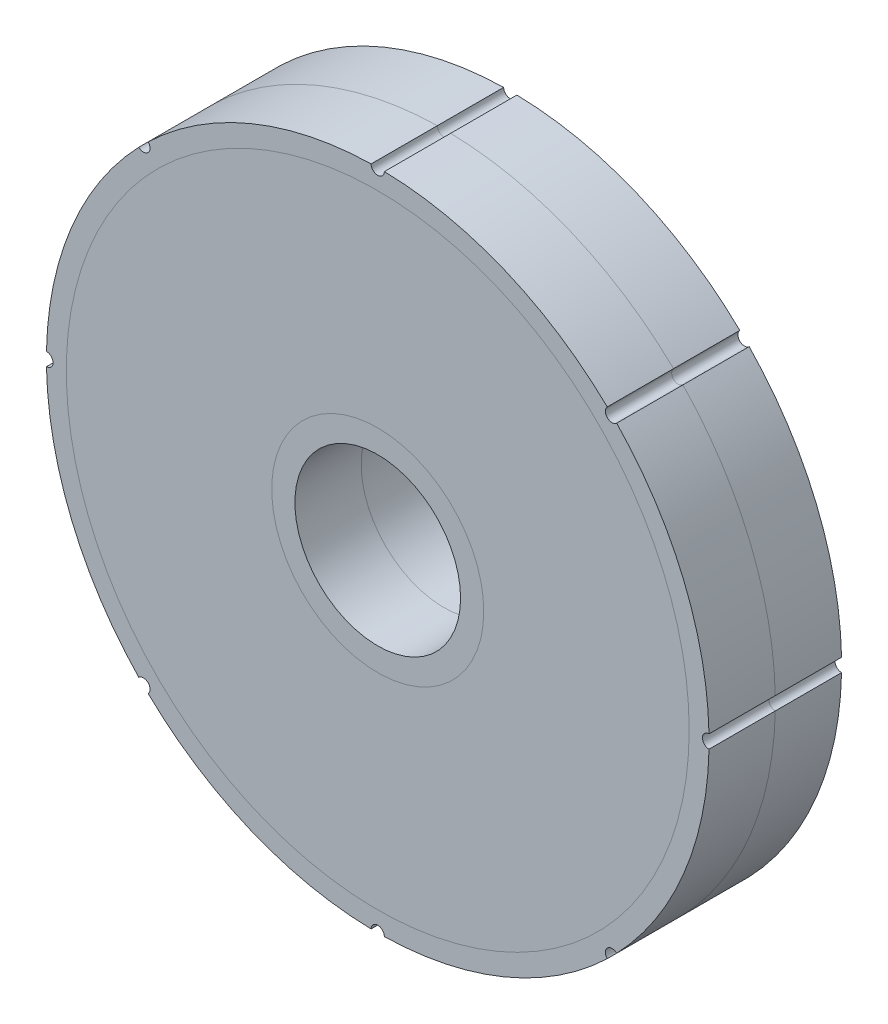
ISO-10303-21;
HEADER;
FILE_DESCRIPTION(('STEP AP214'),'2;1');
FILE_NAME('part.step','',(''),(''),'','','');
FILE_SCHEMA(('AUTOMOTIVE_DESIGN { 1 0 10303 214 1 1 1 1 }'));
ENDSEC;
DATA;
#1=APPLICATION_CONTEXT('core data for automotive mechanical design processes');
#2=APPLICATION_PROTOCOL_DEFINITION('international standard','automotive_design',2000,#1);
#3=PRODUCT_CONTEXT('',#1,'mechanical');
#4=PRODUCT('Part','Part','',(#3));
#5=PRODUCT_RELATED_PRODUCT_CATEGORY('part','',(#4));
#6=PRODUCT_DEFINITION_FORMATION('','',#4);
#7=PRODUCT_DEFINITION_CONTEXT('part definition',#1,'design');
#8=PRODUCT_DEFINITION('design','',#6,#7);
#9=PRODUCT_DEFINITION_SHAPE('','',#8);
#10=(LENGTH_UNIT() NAMED_UNIT(*) SI_UNIT(.MILLI.,.METRE.));
#11=(NAMED_UNIT(*) PLANE_ANGLE_UNIT() SI_UNIT($,.RADIAN.));
#12=(NAMED_UNIT(*) SI_UNIT($,.STERADIAN.) SOLID_ANGLE_UNIT());
#13=UNCERTAINTY_MEASURE_WITH_UNIT(LENGTH_MEASURE(1.E-05),#10,'distance_accuracy_value','');
#14=(GEOMETRIC_REPRESENTATION_CONTEXT(3) GLOBAL_UNCERTAINTY_ASSIGNED_CONTEXT((#13)) GLOBAL_UNIT_ASSIGNED_CONTEXT((#10,
#11,#12)) REPRESENTATION_CONTEXT('',''));
#15=CARTESIAN_POINT('',(0.,0.,0.));
#16=DIRECTION('',(0.,0.,1.));
#17=DIRECTION('',(1.,0.,0.));
#18=AXIS2_PLACEMENT_3D('',#15,#16,#17);
#19=CARTESIAN_POINT('',(0.,0.,0.));
#20=DIRECTION('',(0.,0.,1.));
#21=DIRECTION('',(1.,0.,0.));
#22=AXIS2_PLACEMENT_3D('',#19,#20,#21);
#23=PLANE('',#22);
#24=CARTESIAN_POINT('',(0.,0.,0.));
#25=DIRECTION('',(0.,0.,1.));
#26=DIRECTION('',(1.,0.,0.));
#27=AXIS2_PLACEMENT_3D('',#24,#25,#26);
#28=CIRCLE('',#27,12.5);
#29=CARTESIAN_POINT('',(12.5,0.,0.));
#30=VERTEX_POINT('',#29);
#31=EDGE_CURVE('E66',#30,#30,#28,.T.);
#32=ORIENTED_EDGE('',*,*,#31,.F.);
#33=EDGE_LOOP('',(#32));
#34=FACE_BOUND('',#33,.T.);
#35=CARTESIAN_POINT('',(0.,0.,0.));
#36=DIRECTION('',(0.,0.,1.));
#37=DIRECTION('',(1.,0.,0.));
#38=AXIS2_PLACEMENT_3D('',#35,#36,#37);
#39=CIRCLE('',#38,16.);
#40=CARTESIAN_POINT('',(16.,0.,0.));
#41=VERTEX_POINT('',#40);
#42=EDGE_CURVE('E55',#41,#41,#39,.F.);
#43=ORIENTED_EDGE('',*,*,#42,.F.);
#44=EDGE_LOOP('',(#43));
#45=FACE_BOUND('',#44,.T.);
#46=ADVANCED_FACE('F51',(#34,#45),#23,.T.);
#47=CARTESIAN_POINT('',(0.,0.,-10.));
#48=DIRECTION('',(0.,0.,1.));
#49=DIRECTION('',(1.,0.,0.));
#50=AXIS2_PLACEMENT_3D('',#47,#48,#49);
#51=PLANE('',#50);
#52=CARTESIAN_POINT('',(0.,0.,-10.));
#53=DIRECTION('',(0.,0.,1.));
#54=DIRECTION('',(1.,0.,0.));
#55=AXIS2_PLACEMENT_3D('',#52,#53,#54);
#56=CIRCLE('',#55,12.5);
#57=CARTESIAN_POINT('',(12.5,0.,-10.));
#58=VERTEX_POINT('',#57);
#59=EDGE_CURVE('E60',#58,#58,#56,.T.);
#60=ORIENTED_EDGE('',*,*,#59,.T.);
#61=EDGE_LOOP('',(#60));
#62=FACE_BOUND('',#61,.T.);
#63=CARTESIAN_POINT('',(0.,0.,-10.));
#64=DIRECTION('',(0.,0.,1.));
#65=DIRECTION('',(1.,0.,0.));
#66=AXIS2_PLACEMENT_3D('',#63,#64,#65);
#67=CIRCLE('',#66,16.);
#68=CARTESIAN_POINT('',(16.,0.,-10.));
#69=VERTEX_POINT('',#68);
#70=EDGE_CURVE('E12',#69,#69,#67,.T.);
#71=ORIENTED_EDGE('',*,*,#70,.F.);
#72=EDGE_LOOP('',(#71));
#73=FACE_BOUND('',#72,.T.);
#74=ADVANCED_FACE('F77',(#62,#73),#51,.F.);
#75=CARTESIAN_POINT('',(0.,0.,10.));
#76=DIRECTION('',(0.,0.,-1.));
#77=DIRECTION('',(-1.,0.,0.));
#78=AXIS2_PLACEMENT_3D('',#75,#76,#77);
#79=CYLINDRICAL_SURFACE('',#78,12.5);
#80=ORIENTED_EDGE('',*,*,#59,.F.);
#81=EDGE_LOOP('',(#80));
#82=FACE_BOUND('',#81,.T.);
#83=ORIENTED_EDGE('',*,*,#31,.T.);
#84=EDGE_LOOP('',(#83));
#85=FACE_BOUND('',#84,.T.);
#86=ADVANCED_FACE('F53',(#82,#85),#79,.F.);
#87=CARTESIAN_POINT('',(0.,0.,-10.01));
#88=DIRECTION('',(0.,0.,1.));
#89=DIRECTION('',(1.,0.,0.));
#90=AXIS2_PLACEMENT_3D('',#87,#88,#89);
#91=CYLINDRICAL_SURFACE('',#90,16.);
#92=ORIENTED_EDGE('',*,*,#70,.T.);
#93=EDGE_LOOP('',(#92));
#94=FACE_BOUND('',#93,.T.);
#95=ORIENTED_EDGE('',*,*,#42,.T.);
#96=EDGE_LOOP('',(#95));
#97=FACE_BOUND('',#96,.T.);
#98=ADVANCED_FACE('F74',(#94,#97),#91,.T.);
#99=CLOSED_SHELL('',(#46,#74,#86,#98));
#100=MANIFOLD_SOLID_BREP('B2',#99);
#101=CARTESIAN_POINT('',(0.,0.,0.));
#102=DIRECTION('',(0.,0.,1.));
#103=DIRECTION('',(1.,0.,0.));
#104=AXIS2_PLACEMENT_3D('',#101,#102,#103);
#105=PLANE('',#104);
#106=CARTESIAN_POINT('',(0.,0.,0.));
#107=DIRECTION('',(0.,0.,1.));
#108=DIRECTION('',(1.,0.,0.));
#109=AXIS2_PLACEMENT_3D('',#106,#107,#108);
#110=CIRCLE('',#109,16.);
#111=CARTESIAN_POINT('',(16.,0.,0.));
#112=VERTEX_POINT('',#111);
#113=EDGE_CURVE('E128',#112,#112,#110,.F.);
#114=ORIENTED_EDGE('',*,*,#113,.T.);
#115=EDGE_LOOP('',(#114));
#116=FACE_BOUND('',#115,.T.);
#117=CARTESIAN_POINT('',(0.,0.,0.));
#118=DIRECTION('',(0.,0.,1.));
#119=DIRECTION('',(1.,0.,0.));
#120=AXIS2_PLACEMENT_3D('',#117,#118,#119);
#121=CIRCLE('',#120,12.5);
#122=CARTESIAN_POINT('',(12.5,0.,0.));
#123=VERTEX_POINT('',#122);
#124=EDGE_CURVE('E50',#123,#123,#121,.T.);
#125=ORIENTED_EDGE('',*,*,#124,.T.);
#126=EDGE_LOOP('',(#125));
#127=FACE_BOUND('',#126,.T.);
#128=ADVANCED_FACE('F125',(#116,#127),#105,.F.);
#129=CARTESIAN_POINT('',(0.,0.,-10.01));
#130=DIRECTION('',(0.,0.,1.));
#131=DIRECTION('',(1.,0.,0.));
#132=AXIS2_PLACEMENT_3D('',#129,#130,#131);
#133=CYLINDRICAL_SURFACE('',#132,16.);
#134=ORIENTED_EDGE('',*,*,#113,.F.);
#135=EDGE_LOOP('',(#134));
#136=FACE_BOUND('',#135,.T.);
#137=CARTESIAN_POINT('',(0.,0.,10.));
#138=DIRECTION('',(0.,0.,1.));
#139=DIRECTION('',(1.,0.,0.));
#140=AXIS2_PLACEMENT_3D('',#137,#138,#139);
#141=CIRCLE('',#140,16.);
#142=CARTESIAN_POINT('',(16.,0.,10.));
#143=VERTEX_POINT('',#142);
#144=EDGE_CURVE('E137',#143,#143,#141,.T.);
#145=ORIENTED_EDGE('',*,*,#144,.F.);
#146=EDGE_LOOP('',(#145));
#147=FACE_BOUND('',#146,.T.);
#148=ADVANCED_FACE('F148',(#136,#147),#133,.T.);
#149=CARTESIAN_POINT('',(0.,0.,10.));
#150=DIRECTION('',(0.,0.,-1.));
#151=DIRECTION('',(-1.,0.,0.));
#152=AXIS2_PLACEMENT_3D('',#149,#150,#151);
#153=CYLINDRICAL_SURFACE('',#152,12.5);
#154=ORIENTED_EDGE('',*,*,#124,.F.);
#155=EDGE_LOOP('',(#154));
#156=FACE_BOUND('',#155,.T.);
#157=CARTESIAN_POINT('',(0.,0.,10.));
#158=DIRECTION('',(0.,0.,1.));
#159=DIRECTION('',(1.,0.,0.));
#160=AXIS2_PLACEMENT_3D('',#157,#158,#159);
#161=CIRCLE('',#160,12.5);
#162=CARTESIAN_POINT('',(12.5,0.,10.));
#163=VERTEX_POINT('',#162);
#164=EDGE_CURVE('E135',#163,#163,#161,.T.);
#165=ORIENTED_EDGE('',*,*,#164,.T.);
#166=EDGE_LOOP('',(#165));
#167=FACE_BOUND('',#166,.T.);
#168=ADVANCED_FACE('F143',(#156,#167),#153,.F.);
#169=CARTESIAN_POINT('',(0.,0.,10.));
#170=DIRECTION('',(0.,0.,1.));
#171=DIRECTION('',(1.,0.,0.));
#172=AXIS2_PLACEMENT_3D('',#169,#170,#171);
#173=PLANE('',#172);
#174=ORIENTED_EDGE('',*,*,#164,.F.);
#175=EDGE_LOOP('',(#174));
#176=FACE_BOUND('',#175,.T.);
#177=ORIENTED_EDGE('',*,*,#144,.T.);
#178=EDGE_LOOP('',(#177));
#179=FACE_BOUND('',#178,.T.);
#180=ADVANCED_FACE('F145',(#176,#179),#173,.T.);
#181=CLOSED_SHELL('',(#128,#148,#168,#180));
#182=MANIFOLD_SOLID_BREP('B7',#181);
#183=CARTESIAN_POINT('',(0.,0.,0.));
#184=DIRECTION('',(0.,0.,1.));
#185=DIRECTION('',(1.,0.,0.));
#186=AXIS2_PLACEMENT_3D('',#183,#184,#185);
#187=PLANE('',#186);
#188=CARTESIAN_POINT('',(0.,0.,0.));
#189=DIRECTION('',(0.,0.,1.));
#190=DIRECTION('',(1.,0.,0.));
#191=AXIS2_PLACEMENT_3D('',#188,#189,#190);
#192=CIRCLE('',#191,16.);
#193=CARTESIAN_POINT('',(16.,0.,0.));
#194=VERTEX_POINT('',#193);
#195=EDGE_CURVE('E199',#194,#194,#192,.F.);
#196=ORIENTED_EDGE('',*,*,#195,.T.);
#197=EDGE_LOOP('',(#196));
#198=FACE_BOUND('',#197,.T.);
#199=CARTESIAN_POINT('',(0.,0.,0.));
#200=DIRECTION('',(0.,0.,1.));
#201=DIRECTION('',(1.,0.,0.));
#202=AXIS2_PLACEMENT_3D('',#199,#200,#201);
#203=CIRCLE('',#202,47.);
#204=CARTESIAN_POINT('',(47.,0.,0.));
#205=VERTEX_POINT('',#204);
#206=EDGE_CURVE('E210',#205,#205,#203,.F.);
#207=ORIENTED_EDGE('',*,*,#206,.F.);
#208=EDGE_LOOP('',(#207));
#209=FACE_BOUND('',#208,.T.);
#210=ADVANCED_FACE('F195',(#198,#209),#187,.T.);
#211=CARTESIAN_POINT('',(0.,0.,-10.));
#212=DIRECTION('',(0.,0.,1.));
#213=DIRECTION('',(1.,0.,0.));
#214=AXIS2_PLACEMENT_3D('',#211,#212,#213);
#215=PLANE('',#214);
#216=CARTESIAN_POINT('',(0.,0.,-10.));
#217=DIRECTION('',(0.,0.,1.));
#218=DIRECTION('',(1.,0.,0.));
#219=AXIS2_PLACEMENT_3D('',#216,#217,#218);
#220=CIRCLE('',#219,16.);
#221=CARTESIAN_POINT('',(16.,0.,-10.));
#222=VERTEX_POINT('',#221);
#223=EDGE_CURVE('E204',#222,#222,#220,.T.);
#224=ORIENTED_EDGE('',*,*,#223,.T.);
#225=EDGE_LOOP('',(#224));
#226=FACE_BOUND('',#225,.T.);
#227=CARTESIAN_POINT('',(0.,0.,-10.));
#228=DIRECTION('',(0.,0.,1.));
#229=DIRECTION('',(1.,0.,0.));
#230=AXIS2_PLACEMENT_3D('',#227,#228,#229);
#231=CIRCLE('',#230,47.);
#232=CARTESIAN_POINT('',(47.,0.,-10.));
#233=VERTEX_POINT('',#232);
#234=EDGE_CURVE('E124',#233,#233,#231,.T.);
#235=ORIENTED_EDGE('',*,*,#234,.F.);
#236=EDGE_LOOP('',(#235));
#237=FACE_BOUND('',#236,.T.);
#238=ADVANCED_FACE('F226',(#226,#237),#215,.F.);
#239=CARTESIAN_POINT('',(0.,0.,-10.01));
#240=DIRECTION('',(0.,0.,1.));
#241=DIRECTION('',(1.,0.,0.));
#242=AXIS2_PLACEMENT_3D('',#239,#240,#241);
#243=CYLINDRICAL_SURFACE('',#242,47.);
#244=ORIENTED_EDGE('',*,*,#234,.T.);
#245=EDGE_LOOP('',(#244));
#246=FACE_BOUND('',#245,.T.);
#247=ORIENTED_EDGE('',*,*,#206,.T.);
#248=EDGE_LOOP('',(#247));
#249=FACE_BOUND('',#248,.T.);
#250=ADVANCED_FACE('F197',(#246,#249),#243,.T.);
#251=CARTESIAN_POINT('',(0.,0.,-10.01));
#252=DIRECTION('',(0.,0.,1.));
#253=DIRECTION('',(1.,0.,0.));
#254=AXIS2_PLACEMENT_3D('',#251,#252,#253);
#255=CYLINDRICAL_SURFACE('',#254,16.);
#256=ORIENTED_EDGE('',*,*,#223,.F.);
#257=EDGE_LOOP('',(#256));
#258=FACE_BOUND('',#257,.T.);
#259=ORIENTED_EDGE('',*,*,#195,.F.);
#260=EDGE_LOOP('',(#259));
#261=FACE_BOUND('',#260,.T.);
#262=ADVANCED_FACE('F220',(#258,#261),#255,.F.);
#263=CLOSED_SHELL('',(#210,#238,#250,#262));
#264=MANIFOLD_SOLID_BREP('B45',#263);
#265=CARTESIAN_POINT('',(0.,0.,0.));
#266=DIRECTION('',(0.,0.,1.));
#267=DIRECTION('',(1.,0.,0.));
#268=AXIS2_PLACEMENT_3D('',#265,#266,#267);
#269=PLANE('',#268);
#270=CARTESIAN_POINT('',(0.,0.,0.));
#271=DIRECTION('',(0.,0.,1.));
#272=DIRECTION('',(1.,0.,0.));
#273=AXIS2_PLACEMENT_3D('',#270,#271,#272);
#274=CIRCLE('',#273,47.);
#275=CARTESIAN_POINT('',(47.,0.,0.));
#276=VERTEX_POINT('',#275);
#277=EDGE_CURVE('E194',#276,#276,#274,.F.);
#278=ORIENTED_EDGE('',*,*,#277,.T.);
#279=EDGE_LOOP('',(#278));
#280=FACE_BOUND('',#279,.T.);
#281=CARTESIAN_POINT('',(0.,0.,0.));
#282=DIRECTION('',(0.,0.,1.));
#283=DIRECTION('',(1.,0.,0.));
#284=AXIS2_PLACEMENT_3D('',#281,#282,#283);
#285=CIRCLE('',#284,16.);
#286=CARTESIAN_POINT('',(16.,0.,0.));
#287=VERTEX_POINT('',#286);
#288=EDGE_CURVE('E274',#287,#287,#285,.F.);
#289=ORIENTED_EDGE('',*,*,#288,.F.);
#290=EDGE_LOOP('',(#289));
#291=FACE_BOUND('',#290,.T.);
#292=ADVANCED_FACE('F271',(#280,#291),#269,.F.);
#293=CARTESIAN_POINT('',(0.,0.,-10.01));
#294=DIRECTION('',(0.,0.,1.));
#295=DIRECTION('',(1.,0.,0.));
#296=AXIS2_PLACEMENT_3D('',#293,#294,#295);
#297=CYLINDRICAL_SURFACE('',#296,16.);
#298=ORIENTED_EDGE('',*,*,#288,.T.);
#299=EDGE_LOOP('',(#298));
#300=FACE_BOUND('',#299,.T.);
#301=CARTESIAN_POINT('',(0.,0.,10.));
#302=DIRECTION('',(0.,0.,1.));
#303=DIRECTION('',(1.,0.,0.));
#304=AXIS2_PLACEMENT_3D('',#301,#302,#303);
#305=CIRCLE('',#304,16.);
#306=CARTESIAN_POINT('',(16.,0.,10.));
#307=VERTEX_POINT('',#306);
#308=EDGE_CURVE('E283',#307,#307,#305,.T.);
#309=ORIENTED_EDGE('',*,*,#308,.T.);
#310=EDGE_LOOP('',(#309));
#311=FACE_BOUND('',#310,.T.);
#312=ADVANCED_FACE('F294',(#300,#311),#297,.F.);
#313=CARTESIAN_POINT('',(0.,0.,-10.01));
#314=DIRECTION('',(0.,0.,1.));
#315=DIRECTION('',(1.,0.,0.));
#316=AXIS2_PLACEMENT_3D('',#313,#314,#315);
#317=CYLINDRICAL_SURFACE('',#316,47.);
#318=ORIENTED_EDGE('',*,*,#277,.F.);
#319=EDGE_LOOP('',(#318));
#320=FACE_BOUND('',#319,.T.);
#321=CARTESIAN_POINT('',(0.,0.,10.));
#322=DIRECTION('',(0.,0.,1.));
#323=DIRECTION('',(1.,0.,0.));
#324=AXIS2_PLACEMENT_3D('',#321,#322,#323);
#325=CIRCLE('',#324,47.);
#326=CARTESIAN_POINT('',(47.,0.,10.));
#327=VERTEX_POINT('',#326);
#328=EDGE_CURVE('E281',#327,#327,#325,.T.);
#329=ORIENTED_EDGE('',*,*,#328,.F.);
#330=EDGE_LOOP('',(#329));
#331=FACE_BOUND('',#330,.T.);
#332=ADVANCED_FACE('F292',(#320,#331),#317,.T.);
#333=CARTESIAN_POINT('',(0.,0.,10.));
#334=DIRECTION('',(0.,0.,1.));
#335=DIRECTION('',(1.,0.,0.));
#336=AXIS2_PLACEMENT_3D('',#333,#334,#335);
#337=PLANE('',#336);
#338=ORIENTED_EDGE('',*,*,#308,.F.);
#339=EDGE_LOOP('',(#338));
#340=FACE_BOUND('',#339,.T.);
#341=ORIENTED_EDGE('',*,*,#328,.T.);
#342=EDGE_LOOP('',(#341));
#343=FACE_BOUND('',#342,.T.);
#344=ADVANCED_FACE('F290',(#340,#343),#337,.T.);
#345=CLOSED_SHELL('',(#292,#312,#332,#344));
#346=MANIFOLD_SOLID_BREP('B119',#345);
#347=CARTESIAN_POINT('',(0.,0.,0.));
#348=DIRECTION('',(0.,0.,1.));
#349=DIRECTION('',(1.,0.,0.));
#350=AXIS2_PLACEMENT_3D('',#347,#348,#349);
#351=PLANE('',#350);
#352=CARTESIAN_POINT('',(0.,0.,0.));
#353=DIRECTION('',(0.,0.,1.));
#354=DIRECTION('',(1.,0.,0.));
#355=AXIS2_PLACEMENT_3D('',#352,#353,#354);
#356=CIRCLE('',#355,47.);
#357=CARTESIAN_POINT('',(47.,0.,0.));
#358=VERTEX_POINT('',#357);
#359=EDGE_CURVE('E571',#358,#358,#356,.F.);
#360=ORIENTED_EDGE('',*,*,#359,.T.);
#361=EDGE_LOOP('',(#360));
#362=FACE_BOUND('',#361,.T.);
#363=CARTESIAN_POINT('',(0.,0.,0.));
#364=DIRECTION('',(0.,0.,1.));
#365=DIRECTION('',(1.,0.,0.));
#366=AXIS2_PLACEMENT_3D('',#363,#364,#365);
#367=CIRCLE('',#366,50.);
#368=CARTESIAN_POINT('',(-34.641196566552,-36.055339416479,0.));
#369=VERTEX_POINT('',#368);
#370=CARTESIAN_POINT('',(-0.999949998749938,-49.99,0.));
#371=VERTEX_POINT('',#370);
#372=EDGE_CURVE('E477',#369,#371,#367,.T.);
#373=ORIENTED_EDGE('',*,*,#372,.T.);
#374=CARTESIAN_POINT('',(0.,-50.,0.));
#375=DIRECTION('',(0.,0.,1.));
#376=DIRECTION('',(1.,0.,0.));
#377=AXIS2_PLACEMENT_3D('',#374,#375,#376);
#378=CIRCLE('',#377,1.);
#379=CARTESIAN_POINT('',(0.999949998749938,-49.99,0.));
#380=VERTEX_POINT('',#379);
#381=EDGE_CURVE('E574',#371,#380,#378,.F.);
#382=ORIENTED_EDGE('',*,*,#381,.T.);
#383=CARTESIAN_POINT('',(0.,0.,0.));
#384=DIRECTION('',(0.,0.,1.));
#385=DIRECTION('',(1.,0.,0.));
#386=AXIS2_PLACEMENT_3D('',#383,#384,#385);
#387=CIRCLE('',#386,50.);
#388=CARTESIAN_POINT('',(34.6411965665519,-36.0553394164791,0.));
#389=VERTEX_POINT('',#388);
#390=EDGE_CURVE('E576',#380,#389,#387,.T.);
#391=ORIENTED_EDGE('',*,*,#390,.T.);
#392=CARTESIAN_POINT('',(35.3553390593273,-35.3553390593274,0.));
#393=DIRECTION('',(0.,0.,1.));
#394=DIRECTION('',(1.,0.,0.));
#395=AXIS2_PLACEMENT_3D('',#392,#393,#394);
#396=CIRCLE('',#395,0.999999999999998);
#397=CARTESIAN_POINT('',(36.055339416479,-34.641196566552,0.));
#398=VERTEX_POINT('',#397);
#399=EDGE_CURVE('E579',#389,#398,#396,.F.);
#400=ORIENTED_EDGE('',*,*,#399,.T.);
#401=CARTESIAN_POINT('',(0.,0.,0.));
#402=DIRECTION('',(0.,0.,1.));
#403=DIRECTION('',(1.,0.,0.));
#404=AXIS2_PLACEMENT_3D('',#401,#402,#403);
#405=CIRCLE('',#404,50.);
#406=CARTESIAN_POINT('',(49.99,-0.999949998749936,0.));
#407=VERTEX_POINT('',#406);
#408=EDGE_CURVE('E582',#398,#407,#405,.T.);
#409=ORIENTED_EDGE('',*,*,#408,.T.);
#410=CARTESIAN_POINT('',(50.,0.,0.));
#411=DIRECTION('',(0.,0.,1.));
#412=DIRECTION('',(1.,0.,0.));
#413=AXIS2_PLACEMENT_3D('',#410,#411,#412);
#414=CIRCLE('',#413,0.999999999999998);
#415=CARTESIAN_POINT('',(49.99,0.999949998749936,0.));
#416=VERTEX_POINT('',#415);
#417=EDGE_CURVE('E585',#407,#416,#414,.F.);
#418=ORIENTED_EDGE('',*,*,#417,.T.);
#419=CARTESIAN_POINT('',(0.,0.,0.));
#420=DIRECTION('',(0.,0.,1.));
#421=DIRECTION('',(1.,0.,0.));
#422=AXIS2_PLACEMENT_3D('',#419,#420,#421);
#423=CIRCLE('',#422,50.);
#424=CARTESIAN_POINT('',(36.0553394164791,34.6411965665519,0.));
#425=VERTEX_POINT('',#424);
#426=EDGE_CURVE('E588',#416,#425,#423,.T.);
#427=ORIENTED_EDGE('',*,*,#426,.T.);
#428=CARTESIAN_POINT('',(35.3553390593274,35.3553390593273,0.));
#429=DIRECTION('',(0.,0.,1.));
#430=DIRECTION('',(1.,0.,0.));
#431=AXIS2_PLACEMENT_3D('',#428,#429,#430);
#432=CIRCLE('',#431,0.999999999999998);
#433=CARTESIAN_POINT('',(34.641196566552,36.055339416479,0.));
#434=VERTEX_POINT('',#433);
#435=EDGE_CURVE('E591',#425,#434,#432,.F.);
#436=ORIENTED_EDGE('',*,*,#435,.T.);
#437=CARTESIAN_POINT('',(0.,0.,0.));
#438=DIRECTION('',(0.,0.,1.));
#439=DIRECTION('',(1.,0.,0.));
#440=AXIS2_PLACEMENT_3D('',#437,#438,#439);
#441=CIRCLE('',#440,50.);
#442=CARTESIAN_POINT('',(0.999949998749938,49.99,0.));
#443=VERTEX_POINT('',#442);
#444=EDGE_CURVE('E594',#434,#443,#441,.T.);
#445=ORIENTED_EDGE('',*,*,#444,.T.);
#446=CARTESIAN_POINT('',(0.,50.,0.));
#447=DIRECTION('',(0.,0.,1.));
#448=DIRECTION('',(1.,0.,0.));
#449=AXIS2_PLACEMENT_3D('',#446,#447,#448);
#450=CIRCLE('',#449,1.);
#451=CARTESIAN_POINT('',(-0.999949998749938,49.99,0.));
#452=VERTEX_POINT('',#451);
#453=EDGE_CURVE('E596',#443,#452,#450,.F.);
#454=ORIENTED_EDGE('',*,*,#453,.T.);
#455=CARTESIAN_POINT('',(0.,0.,0.));
#456=DIRECTION('',(0.,0.,1.));
#457=DIRECTION('',(1.,0.,0.));
#458=AXIS2_PLACEMENT_3D('',#455,#456,#457);
#459=CIRCLE('',#458,50.);
#460=CARTESIAN_POINT('',(-34.6411965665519,36.0553394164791,0.));
#461=VERTEX_POINT('',#460);
#462=EDGE_CURVE('E599',#452,#461,#459,.T.);
#463=ORIENTED_EDGE('',*,*,#462,.T.);
#464=CARTESIAN_POINT('',(-35.3553390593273,35.3553390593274,0.));
#465=DIRECTION('',(0.,0.,1.));
#466=DIRECTION('',(1.,0.,0.));
#467=AXIS2_PLACEMENT_3D('',#464,#465,#466);
#468=CIRCLE('',#467,0.999999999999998);
#469=CARTESIAN_POINT('',(-36.055339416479,34.641196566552,0.));
#470=VERTEX_POINT('',#469);
#471=EDGE_CURVE('E602',#461,#470,#468,.F.);
#472=ORIENTED_EDGE('',*,*,#471,.T.);
#473=CARTESIAN_POINT('',(0.,0.,0.));
#474=DIRECTION('',(0.,0.,1.));
#475=DIRECTION('',(1.,0.,0.));
#476=AXIS2_PLACEMENT_3D('',#473,#474,#475);
#477=CIRCLE('',#476,50.);
#478=CARTESIAN_POINT('',(-49.99,0.999949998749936,0.));
#479=VERTEX_POINT('',#478);
#480=EDGE_CURVE('E605',#470,#479,#477,.T.);
#481=ORIENTED_EDGE('',*,*,#480,.T.);
#482=CARTESIAN_POINT('',(-50.,0.,0.));
#483=DIRECTION('',(0.,0.,1.));
#484=DIRECTION('',(1.,0.,0.));
#485=AXIS2_PLACEMENT_3D('',#482,#483,#484);
#486=CIRCLE('',#485,0.999999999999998);
#487=CARTESIAN_POINT('',(-49.99,-0.999949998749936,0.));
#488=VERTEX_POINT('',#487);
#489=EDGE_CURVE('E608',#479,#488,#486,.F.);
#490=ORIENTED_EDGE('',*,*,#489,.T.);
#491=CARTESIAN_POINT('',(0.,0.,0.));
#492=DIRECTION('',(0.,0.,1.));
#493=DIRECTION('',(1.,0.,0.));
#494=AXIS2_PLACEMENT_3D('',#491,#492,#493);
#495=CIRCLE('',#494,50.);
#496=CARTESIAN_POINT('',(-36.0553394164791,-34.6411965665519,0.));
#497=VERTEX_POINT('',#496);
#498=EDGE_CURVE('E480',#488,#497,#495,.T.);
#499=ORIENTED_EDGE('',*,*,#498,.T.);
#500=CARTESIAN_POINT('',(-35.3553390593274,-35.3553390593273,0.));
#501=DIRECTION('',(0.,0.,1.));
#502=DIRECTION('',(1.,0.,0.));
#503=AXIS2_PLACEMENT_3D('',#500,#501,#502);
#504=CIRCLE('',#503,0.999999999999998);
#505=EDGE_CURVE('E465',#497,#369,#504,.F.);
#506=ORIENTED_EDGE('',*,*,#505,.T.);
#507=EDGE_LOOP('',(#373,#382,#391,#400,#409,#418,#427,#436,#445,#454,#463,#472,#481,#490,#499,#506));
#508=FACE_BOUND('',#507,.T.);
#509=ADVANCED_FACE('F345',(#362,#508),#351,.T.);
#510=CARTESIAN_POINT('',(0.,0.,-10.01));
#511=DIRECTION('',(0.,0.,1.));
#512=DIRECTION('',(1.,0.,0.));
#513=AXIS2_PLACEMENT_3D('',#510,#511,#512);
#514=CYLINDRICAL_SURFACE('',#513,47.);
#515=CARTESIAN_POINT('',(0.,0.,-10.));
#516=DIRECTION('',(0.,0.,1.));
#517=DIRECTION('',(1.,0.,0.));
#518=AXIS2_PLACEMENT_3D('',#515,#516,#517);
#519=CIRCLE('',#518,47.);
#520=CARTESIAN_POINT('',(47.,0.,-10.));
#521=VERTEX_POINT('',#520);
#522=EDGE_CURVE('E488',#521,#521,#519,.T.);
#523=ORIENTED_EDGE('',*,*,#522,.F.);
#524=EDGE_LOOP('',(#523));
#525=FACE_BOUND('',#524,.T.);
#526=ORIENTED_EDGE('',*,*,#359,.F.);
#527=EDGE_LOOP('',(#526));
#528=FACE_BOUND('',#527,.T.);
#529=ADVANCED_FACE('F347',(#525,#528),#514,.F.);
#530=CARTESIAN_POINT('',(0.,-50.,-10.));
#531=DIRECTION('',(0.,0.,1.));
#532=DIRECTION('',(1.,0.,0.));
#533=AXIS2_PLACEMENT_3D('',#530,#531,#532);
#534=CYLINDRICAL_SURFACE('',#533,1.);
#535=ORIENTED_EDGE('',*,*,#381,.F.);
#536=DIRECTION('',(0.,0.,1.));
#537=VECTOR('',#536,1.);
#538=CARTESIAN_POINT('',(-0.999949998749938,-49.99,0.));
#539=LINE('',#538,#537);
#540=CARTESIAN_POINT('',(-0.999949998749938,-49.99,-10.));
#541=VERTEX_POINT('',#540);
#542=EDGE_CURVE('E483',#541,#371,#539,.T.);
#543=ORIENTED_EDGE('',*,*,#542,.F.);
#544=CARTESIAN_POINT('',(0.,-50.,-10.));
#545=DIRECTION('',(0.,0.,1.));
#546=DIRECTION('',(1.,0.,0.));
#547=AXIS2_PLACEMENT_3D('',#544,#545,#546);
#548=CIRCLE('',#547,1.);
#549=CARTESIAN_POINT('',(0.999949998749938,-49.99,-10.));
#550=VERTEX_POINT('',#549);
#551=EDGE_CURVE('E556',#550,#541,#548,.T.);
#552=ORIENTED_EDGE('',*,*,#551,.F.);
#553=DIRECTION('',(0.,0.,1.));
#554=VECTOR('',#553,1.);
#555=CARTESIAN_POINT('',(0.999949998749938,-49.99,0.));
#556=LINE('',#555,#554);
#557=EDGE_CURVE('E502',#380,#550,#556,.F.);
#558=ORIENTED_EDGE('',*,*,#557,.F.);
#559=EDGE_LOOP('',(#535,#543,#552,#558));
#560=FACE_BOUND('',#559,.T.);
#561=ADVANCED_FACE('F625',(#560),#534,.F.);
#562=CARTESIAN_POINT('',(0.,0.,10.));
#563=DIRECTION('',(0.,0.,-1.));
#564=DIRECTION('',(-1.,0.,0.));
#565=AXIS2_PLACEMENT_3D('',#562,#563,#564);
#566=CYLINDRICAL_SURFACE('',#565,50.);
#567=ORIENTED_EDGE('',*,*,#390,.F.);
#568=ORIENTED_EDGE('',*,*,#557,.T.);
#569=CARTESIAN_POINT('',(0.,0.,-10.));
#570=DIRECTION('',(0.,0.,1.));
#571=DIRECTION('',(1.,0.,0.));
#572=AXIS2_PLACEMENT_3D('',#569,#570,#571);
#573=CIRCLE('',#572,50.);
#574=CARTESIAN_POINT('',(34.6411965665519,-36.0553394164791,-10.));
#575=VERTEX_POINT('',#574);
#576=EDGE_CURVE('E540',#550,#575,#573,.T.);
#577=ORIENTED_EDGE('',*,*,#576,.T.);
#578=DIRECTION('',(0.,0.,1.));
#579=VECTOR('',#578,1.);
#580=CARTESIAN_POINT('',(34.6411965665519,-36.0553394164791,0.));
#581=LINE('',#580,#579);
#582=EDGE_CURVE('E470',#575,#389,#581,.T.);
#583=ORIENTED_EDGE('',*,*,#582,.T.);
#584=EDGE_LOOP('',(#567,#568,#577,#583));
#585=FACE_BOUND('',#584,.T.);
#586=ADVANCED_FACE('F631',(#585),#566,.T.);
#587=CARTESIAN_POINT('',(35.3553390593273,-35.3553390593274,-10.));
#588=DIRECTION('',(0.,0.,1.));
#589=DIRECTION('',(1.,0.,0.));
#590=AXIS2_PLACEMENT_3D('',#587,#588,#589);
#591=CYLINDRICAL_SURFACE('',#590,0.999999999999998);
#592=ORIENTED_EDGE('',*,*,#399,.F.);
#593=ORIENTED_EDGE('',*,*,#582,.F.);
#594=CARTESIAN_POINT('',(35.3553390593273,-35.3553390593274,-10.));
#595=DIRECTION('',(0.,0.,1.));
#596=DIRECTION('',(1.,0.,0.));
#597=AXIS2_PLACEMENT_3D('',#594,#595,#596);
#598=CIRCLE('',#597,0.999999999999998);
#599=CARTESIAN_POINT('',(36.055339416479,-34.641196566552,-10.));
#600=VERTEX_POINT('',#599);
#601=EDGE_CURVE('E354',#600,#575,#598,.T.);
#602=ORIENTED_EDGE('',*,*,#601,.F.);
#603=DIRECTION('',(0.,0.,1.));
#604=VECTOR('',#603,1.);
#605=CARTESIAN_POINT('',(36.055339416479,-34.641196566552,0.));
#606=LINE('',#605,#604);
#607=EDGE_CURVE('E491',#398,#600,#606,.F.);
#608=ORIENTED_EDGE('',*,*,#607,.F.);
#609=EDGE_LOOP('',(#592,#593,#602,#608));
#610=FACE_BOUND('',#609,.T.);
#611=ADVANCED_FACE('F646',(#610),#591,.F.);
#612=ORIENTED_EDGE('',*,*,#408,.F.);
#613=ORIENTED_EDGE('',*,*,#607,.T.);
#614=CARTESIAN_POINT('',(49.99,-0.999949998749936,-10.));
#615=VERTEX_POINT('',#614);
#616=EDGE_CURVE('E535',#600,#615,#573,.T.);
#617=ORIENTED_EDGE('',*,*,#616,.T.);
#618=DIRECTION('',(0.,0.,1.));
#619=VECTOR('',#618,1.);
#620=CARTESIAN_POINT('',(49.99,-0.999949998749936,0.));
#621=LINE('',#620,#619);
#622=EDGE_CURVE('E370',#615,#407,#621,.T.);
#623=ORIENTED_EDGE('',*,*,#622,.T.);
#624=EDGE_LOOP('',(#612,#613,#617,#623));
#625=FACE_BOUND('',#624,.T.);
#626=ADVANCED_FACE('F647',(#625),#566,.T.);
#627=CARTESIAN_POINT('',(50.,0.,-10.));
#628=DIRECTION('',(0.,0.,1.));
#629=DIRECTION('',(1.,0.,0.));
#630=AXIS2_PLACEMENT_3D('',#627,#628,#629);
#631=CYLINDRICAL_SURFACE('',#630,0.999999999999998);
#632=ORIENTED_EDGE('',*,*,#417,.F.);
#633=ORIENTED_EDGE('',*,*,#622,.F.);
#634=CARTESIAN_POINT('',(50.,0.,-10.));
#635=DIRECTION('',(0.,0.,1.));
#636=DIRECTION('',(1.,0.,0.));
#637=AXIS2_PLACEMENT_3D('',#634,#635,#636);
#638=CIRCLE('',#637,0.999999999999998);
#639=CARTESIAN_POINT('',(49.99,0.999949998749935,-10.));
#640=VERTEX_POINT('',#639);
#641=EDGE_CURVE('E560',#640,#615,#638,.T.);
#642=ORIENTED_EDGE('',*,*,#641,.F.);
#643=DIRECTION('',(0.,0.,1.));
#644=VECTOR('',#643,1.);
#645=CARTESIAN_POINT('',(49.99,0.999949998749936,0.));
#646=LINE('',#645,#644);
#647=EDGE_CURVE('E505',#416,#640,#646,.F.);
#648=ORIENTED_EDGE('',*,*,#647,.F.);
#649=EDGE_LOOP('',(#632,#633,#642,#648));
#650=FACE_BOUND('',#649,.T.);
#651=ADVANCED_FACE('F651',(#650),#631,.F.);
#652=ORIENTED_EDGE('',*,*,#426,.F.);
#653=ORIENTED_EDGE('',*,*,#647,.T.);
#654=CARTESIAN_POINT('',(36.0553394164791,34.6411965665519,-10.));
#655=VERTEX_POINT('',#654);
#656=EDGE_CURVE('E530',#640,#655,#573,.T.);
#657=ORIENTED_EDGE('',*,*,#656,.T.);
#658=DIRECTION('',(0.,0.,1.));
#659=VECTOR('',#658,1.);
#660=CARTESIAN_POINT('',(36.0553394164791,34.6411965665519,0.));
#661=LINE('',#660,#659);
#662=EDGE_CURVE('E493',#655,#425,#661,.T.);
#663=ORIENTED_EDGE('',*,*,#662,.T.);
#664=EDGE_LOOP('',(#652,#653,#657,#663));
#665=FACE_BOUND('',#664,.T.);
#666=ADVANCED_FACE('F654',(#665),#566,.T.);
#667=CARTESIAN_POINT('',(35.3553390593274,35.3553390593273,-10.));
#668=DIRECTION('',(0.,0.,1.));
#669=DIRECTION('',(1.,0.,0.));
#670=AXIS2_PLACEMENT_3D('',#667,#668,#669);
#671=CYLINDRICAL_SURFACE('',#670,0.999999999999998);
#672=ORIENTED_EDGE('',*,*,#435,.F.);
#673=ORIENTED_EDGE('',*,*,#662,.F.);
#674=CARTESIAN_POINT('',(35.3553390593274,35.3553390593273,-10.));
#675=DIRECTION('',(0.,0.,1.));
#676=DIRECTION('',(1.,0.,0.));
#677=AXIS2_PLACEMENT_3D('',#674,#675,#676);
#678=CIRCLE('',#677,0.999999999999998);
#679=CARTESIAN_POINT('',(34.641196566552,36.055339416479,-10.));
#680=VERTEX_POINT('',#679);
#681=EDGE_CURVE('E563',#680,#655,#678,.T.);
#682=ORIENTED_EDGE('',*,*,#681,.F.);
#683=DIRECTION('',(0.,0.,1.));
#684=VECTOR('',#683,1.);
#685=CARTESIAN_POINT('',(34.641196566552,36.055339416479,0.));
#686=LINE('',#685,#684);
#687=EDGE_CURVE('E495',#434,#680,#686,.F.);
#688=ORIENTED_EDGE('',*,*,#687,.F.);
#689=EDGE_LOOP('',(#672,#673,#682,#688));
#690=FACE_BOUND('',#689,.T.);
#691=ADVANCED_FACE('F655',(#690),#671,.F.);
#692=ORIENTED_EDGE('',*,*,#444,.F.);
#693=ORIENTED_EDGE('',*,*,#687,.T.);
#694=CARTESIAN_POINT('',(0.999949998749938,49.99,-10.));
#695=VERTEX_POINT('',#694);
#696=EDGE_CURVE('E523',#680,#695,#573,.T.);
#697=ORIENTED_EDGE('',*,*,#696,.T.);
#698=DIRECTION('',(0.,0.,1.));
#699=VECTOR('',#698,1.);
#700=CARTESIAN_POINT('',(0.999949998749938,49.99,0.));
#701=LINE('',#700,#699);
#702=EDGE_CURVE('E509',#695,#443,#701,.T.);
#703=ORIENTED_EDGE('',*,*,#702,.T.);
#704=EDGE_LOOP('',(#692,#693,#697,#703));
#705=FACE_BOUND('',#704,.T.);
#706=ADVANCED_FACE('F658',(#705),#566,.T.);
#707=CARTESIAN_POINT('',(0.,50.,-10.));
#708=DIRECTION('',(0.,0.,1.));
#709=DIRECTION('',(1.,0.,0.));
#710=AXIS2_PLACEMENT_3D('',#707,#708,#709);
#711=CYLINDRICAL_SURFACE('',#710,1.);
#712=ORIENTED_EDGE('',*,*,#453,.F.);
#713=ORIENTED_EDGE('',*,*,#702,.F.);
#714=CARTESIAN_POINT('',(0.,50.,-10.));
#715=DIRECTION('',(0.,0.,1.));
#716=DIRECTION('',(1.,0.,0.));
#717=AXIS2_PLACEMENT_3D('',#714,#715,#716);
#718=CIRCLE('',#717,1.);
#719=CARTESIAN_POINT('',(-0.999949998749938,49.99,-10.));
#720=VERTEX_POINT('',#719);
#721=EDGE_CURVE('E529',#720,#695,#718,.T.);
#722=ORIENTED_EDGE('',*,*,#721,.F.);
#723=DIRECTION('',(0.,0.,1.));
#724=VECTOR('',#723,1.);
#725=CARTESIAN_POINT('',(-0.999949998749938,49.99,0.));
#726=LINE('',#725,#724);
#727=EDGE_CURVE('E349',#452,#720,#726,.F.);
#728=ORIENTED_EDGE('',*,*,#727,.F.);
#729=EDGE_LOOP('',(#712,#713,#722,#728));
#730=FACE_BOUND('',#729,.T.);
#731=ADVANCED_FACE('F660',(#730),#711,.F.);
#732=ORIENTED_EDGE('',*,*,#462,.F.);
#733=ORIENTED_EDGE('',*,*,#727,.T.);
#734=CARTESIAN_POINT('',(-34.6411965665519,36.0553394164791,-10.));
#735=VERTEX_POINT('',#734);
#736=EDGE_CURVE('E515',#720,#735,#573,.T.);
#737=ORIENTED_EDGE('',*,*,#736,.T.);
#738=DIRECTION('',(0.,0.,1.));
#739=VECTOR('',#738,1.);
#740=CARTESIAN_POINT('',(-34.6411965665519,36.0553394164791,0.));
#741=LINE('',#740,#739);
#742=EDGE_CURVE('E497',#735,#461,#741,.T.);
#743=ORIENTED_EDGE('',*,*,#742,.T.);
#744=EDGE_LOOP('',(#732,#733,#737,#743));
#745=FACE_BOUND('',#744,.T.);
#746=ADVANCED_FACE('F621',(#745),#566,.T.);
#747=CARTESIAN_POINT('',(-35.3553390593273,35.3553390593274,-10.));
#748=DIRECTION('',(0.,0.,1.));
#749=DIRECTION('',(1.,0.,0.));
#750=AXIS2_PLACEMENT_3D('',#747,#748,#749);
#751=CYLINDRICAL_SURFACE('',#750,0.999999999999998);
#752=ORIENTED_EDGE('',*,*,#471,.F.);
#753=ORIENTED_EDGE('',*,*,#742,.F.);
#754=CARTESIAN_POINT('',(-35.3553390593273,35.3553390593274,-10.));
#755=DIRECTION('',(0.,0.,1.));
#756=DIRECTION('',(1.,0.,0.));
#757=AXIS2_PLACEMENT_3D('',#754,#755,#756);
#758=CIRCLE('',#757,0.999999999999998);
#759=CARTESIAN_POINT('',(-36.055339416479,34.641196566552,-10.));
#760=VERTEX_POINT('',#759);
#761=EDGE_CURVE('E559',#760,#735,#758,.T.);
#762=ORIENTED_EDGE('',*,*,#761,.F.);
#763=DIRECTION('',(0.,0.,1.));
#764=VECTOR('',#763,1.);
#765=CARTESIAN_POINT('',(-36.055339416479,34.641196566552,0.));
#766=LINE('',#765,#764);
#767=EDGE_CURVE('E499',#470,#760,#766,.F.);
#768=ORIENTED_EDGE('',*,*,#767,.F.);
#769=EDGE_LOOP('',(#752,#753,#762,#768));
#770=FACE_BOUND('',#769,.T.);
#771=ADVANCED_FACE('F619',(#770),#751,.F.);
#772=ORIENTED_EDGE('',*,*,#480,.F.);
#773=ORIENTED_EDGE('',*,*,#767,.T.);
#774=CARTESIAN_POINT('',(-49.99,0.999949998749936,-10.));
#775=VERTEX_POINT('',#774);
#776=EDGE_CURVE('E521',#760,#775,#573,.T.);
#777=ORIENTED_EDGE('',*,*,#776,.T.);
#778=DIRECTION('',(0.,0.,1.));
#779=VECTOR('',#778,1.);
#780=CARTESIAN_POINT('',(-49.99,0.999949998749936,0.));
#781=LINE('',#780,#779);
#782=EDGE_CURVE('E362',#775,#479,#781,.T.);
#783=ORIENTED_EDGE('',*,*,#782,.T.);
#784=EDGE_LOOP('',(#772,#773,#777,#783));
#785=FACE_BOUND('',#784,.T.);
#786=ADVANCED_FACE('F612',(#785),#566,.T.);
#787=CARTESIAN_POINT('',(-50.,0.,-10.));
#788=DIRECTION('',(0.,0.,1.));
#789=DIRECTION('',(1.,0.,0.));
#790=AXIS2_PLACEMENT_3D('',#787,#788,#789);
#791=CYLINDRICAL_SURFACE('',#790,0.999999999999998);
#792=ORIENTED_EDGE('',*,*,#489,.F.);
#793=ORIENTED_EDGE('',*,*,#782,.F.);
#794=CARTESIAN_POINT('',(-50.,0.,-10.));
#795=DIRECTION('',(0.,0.,1.));
#796=DIRECTION('',(1.,0.,0.));
#797=AXIS2_PLACEMENT_3D('',#794,#795,#796);
#798=CIRCLE('',#797,0.999999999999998);
#799=CARTESIAN_POINT('',(-49.99,-0.999949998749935,-10.));
#800=VERTEX_POINT('',#799);
#801=EDGE_CURVE('E533',#800,#775,#798,.T.);
#802=ORIENTED_EDGE('',*,*,#801,.F.);
#803=DIRECTION('',(0.,0.,1.));
#804=VECTOR('',#803,1.);
#805=CARTESIAN_POINT('',(-49.99,-0.999949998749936,0.));
#806=LINE('',#805,#804);
#807=EDGE_CURVE('E508',#488,#800,#806,.F.);
#808=ORIENTED_EDGE('',*,*,#807,.F.);
#809=EDGE_LOOP('',(#792,#793,#802,#808));
#810=FACE_BOUND('',#809,.T.);
#811=ADVANCED_FACE('F610',(#810),#791,.F.);
#812=ORIENTED_EDGE('',*,*,#498,.F.);
#813=ORIENTED_EDGE('',*,*,#807,.T.);
#814=CARTESIAN_POINT('',(-36.0553394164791,-34.6411965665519,-10.));
#815=VERTEX_POINT('',#814);
#816=EDGE_CURVE('E526',#800,#815,#573,.T.);
#817=ORIENTED_EDGE('',*,*,#816,.T.);
#818=DIRECTION('',(0.,0.,1.));
#819=VECTOR('',#818,1.);
#820=CARTESIAN_POINT('',(-36.0553394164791,-34.6411965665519,0.));
#821=LINE('',#820,#819);
#822=EDGE_CURVE('E471',#815,#497,#821,.T.);
#823=ORIENTED_EDGE('',*,*,#822,.T.);
#824=EDGE_LOOP('',(#812,#813,#817,#823));
#825=FACE_BOUND('',#824,.T.);
#826=ADVANCED_FACE('F550',(#825),#566,.T.);
#827=CARTESIAN_POINT('',(-35.3553390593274,-35.3553390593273,-10.));
#828=DIRECTION('',(0.,0.,1.));
#829=DIRECTION('',(1.,0.,0.));
#830=AXIS2_PLACEMENT_3D('',#827,#828,#829);
#831=CYLINDRICAL_SURFACE('',#830,0.999999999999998);
#832=ORIENTED_EDGE('',*,*,#505,.F.);
#833=ORIENTED_EDGE('',*,*,#822,.F.);
#834=CARTESIAN_POINT('',(-35.3553390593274,-35.3553390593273,-10.));
#835=DIRECTION('',(0.,0.,1.));
#836=DIRECTION('',(1.,0.,0.));
#837=AXIS2_PLACEMENT_3D('',#834,#835,#836);
#838=CIRCLE('',#837,0.999999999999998);
#839=CARTESIAN_POINT('',(-34.641196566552,-36.055339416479,-10.));
#840=VERTEX_POINT('',#839);
#841=EDGE_CURVE('E269',#840,#815,#838,.T.);
#842=ORIENTED_EDGE('',*,*,#841,.F.);
#843=DIRECTION('',(0.,0.,1.));
#844=VECTOR('',#843,1.);
#845=CARTESIAN_POINT('',(-34.641196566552,-36.055339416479,0.));
#846=LINE('',#845,#844);
#847=EDGE_CURVE('E462',#369,#840,#846,.F.);
#848=ORIENTED_EDGE('',*,*,#847,.F.);
#849=EDGE_LOOP('',(#832,#833,#842,#848));
#850=FACE_BOUND('',#849,.T.);
#851=ADVANCED_FACE('F464',(#850),#831,.F.);
#852=ORIENTED_EDGE('',*,*,#372,.F.);
#853=ORIENTED_EDGE('',*,*,#847,.T.);
#854=EDGE_CURVE('E544',#840,#541,#573,.T.);
#855=ORIENTED_EDGE('',*,*,#854,.T.);
#856=ORIENTED_EDGE('',*,*,#542,.T.);
#857=EDGE_LOOP('',(#852,#853,#855,#856));
#858=FACE_BOUND('',#857,.T.);
#859=ADVANCED_FACE('F482',(#858),#566,.T.);
#860=CARTESIAN_POINT('',(0.,0.,-10.));
#861=DIRECTION('',(0.,0.,1.));
#862=DIRECTION('',(1.,0.,0.));
#863=AXIS2_PLACEMENT_3D('',#860,#861,#862);
#864=PLANE('',#863);
#865=ORIENTED_EDGE('',*,*,#522,.T.);
#866=EDGE_LOOP('',(#865));
#867=FACE_BOUND('',#866,.T.);
#868=ORIENTED_EDGE('',*,*,#854,.F.);
#869=ORIENTED_EDGE('',*,*,#841,.T.);
#870=ORIENTED_EDGE('',*,*,#816,.F.);
#871=ORIENTED_EDGE('',*,*,#801,.T.);
#872=ORIENTED_EDGE('',*,*,#776,.F.);
#873=ORIENTED_EDGE('',*,*,#761,.T.);
#874=ORIENTED_EDGE('',*,*,#736,.F.);
#875=ORIENTED_EDGE('',*,*,#721,.T.);
#876=ORIENTED_EDGE('',*,*,#696,.F.);
#877=ORIENTED_EDGE('',*,*,#681,.T.);
#878=ORIENTED_EDGE('',*,*,#656,.F.);
#879=ORIENTED_EDGE('',*,*,#641,.T.);
#880=ORIENTED_EDGE('',*,*,#616,.F.);
#881=ORIENTED_EDGE('',*,*,#601,.T.);
#882=ORIENTED_EDGE('',*,*,#576,.F.);
#883=ORIENTED_EDGE('',*,*,#551,.T.);
#884=EDGE_LOOP('',(#868,#869,#870,#871,#872,#873,#874,#875,#876,#877,#878,#879,#880,#881,#882,#883));
#885=FACE_BOUND('',#884,.T.);
#886=ADVANCED_FACE('F552',(#867,#885),#864,.F.);
#887=CLOSED_SHELL('',(#509,#529,#561,#586,#611,#626,#651,#666,#691,#706,#731,#746,#771,#786,
#811,#826,#851,#859,#886));
#888=MANIFOLD_SOLID_BREP('B189',#887);
#889=CARTESIAN_POINT('',(0.,0.,0.));
#890=DIRECTION('',(0.,0.,1.));
#891=DIRECTION('',(1.,0.,0.));
#892=AXIS2_PLACEMENT_3D('',#889,#890,#891);
#893=PLANE('',#892);
#894=CARTESIAN_POINT('',(0.,0.,0.));
#895=DIRECTION('',(0.,0.,1.));
#896=DIRECTION('',(1.,0.,0.));
#897=AXIS2_PLACEMENT_3D('',#894,#895,#896);
#898=CIRCLE('',#897,50.);
#899=CARTESIAN_POINT('',(-34.641196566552,-36.055339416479,0.));
#900=VERTEX_POINT('',#899);
#901=CARTESIAN_POINT('',(-0.999949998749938,-49.99,0.));
#902=VERTEX_POINT('',#901);
#903=EDGE_CURVE('E977',#900,#902,#898,.T.);
#904=ORIENTED_EDGE('',*,*,#903,.F.);
#905=CARTESIAN_POINT('',(-35.3553390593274,-35.3553390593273,0.));
#906=DIRECTION('',(0.,0.,1.));
#907=DIRECTION('',(1.,0.,0.));
#908=AXIS2_PLACEMENT_3D('',#905,#906,#907);
#909=CIRCLE('',#908,0.999999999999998);
#910=CARTESIAN_POINT('',(-36.0553394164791,-34.6411965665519,0.));
#911=VERTEX_POINT('',#910);
#912=EDGE_CURVE('E980',#911,#900,#909,.F.);
#913=ORIENTED_EDGE('',*,*,#912,.F.);
#914=CARTESIAN_POINT('',(0.,0.,0.));
#915=DIRECTION('',(0.,0.,1.));
#916=DIRECTION('',(1.,0.,0.));
#917=AXIS2_PLACEMENT_3D('',#914,#915,#916);
#918=CIRCLE('',#917,50.);
#919=CARTESIAN_POINT('',(-49.99,-0.999949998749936,0.));
#920=VERTEX_POINT('',#919);
#921=EDGE_CURVE('E982',#920,#911,#918,.T.);
#922=ORIENTED_EDGE('',*,*,#921,.F.);
#923=CARTESIAN_POINT('',(-50.,0.,0.));
#924=DIRECTION('',(0.,0.,1.));
#925=DIRECTION('',(1.,0.,0.));
#926=AXIS2_PLACEMENT_3D('',#923,#924,#925);
#927=CIRCLE('',#926,0.999999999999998);
#928=CARTESIAN_POINT('',(-49.99,0.999949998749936,0.));
#929=VERTEX_POINT('',#928);
#930=EDGE_CURVE('E984',#929,#920,#927,.F.);
#931=ORIENTED_EDGE('',*,*,#930,.F.);
#932=CARTESIAN_POINT('',(0.,0.,0.));
#933=DIRECTION('',(0.,0.,1.));
#934=DIRECTION('',(1.,0.,0.));
#935=AXIS2_PLACEMENT_3D('',#932,#933,#934);
#936=CIRCLE('',#935,50.);
#937=CARTESIAN_POINT('',(-36.055339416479,34.641196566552,0.));
#938=VERTEX_POINT('',#937);
#939=EDGE_CURVE('E910',#938,#929,#936,.T.);
#940=ORIENTED_EDGE('',*,*,#939,.F.);
#941=CARTESIAN_POINT('',(-35.3553390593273,35.3553390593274,0.));
#942=DIRECTION('',(0.,0.,1.));
#943=DIRECTION('',(1.,0.,0.));
#944=AXIS2_PLACEMENT_3D('',#941,#942,#943);
#945=CIRCLE('',#944,0.999999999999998);
#946=CARTESIAN_POINT('',(-34.6411965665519,36.0553394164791,0.));
#947=VERTEX_POINT('',#946);
#948=EDGE_CURVE('E987',#947,#938,#945,.F.);
#949=ORIENTED_EDGE('',*,*,#948,.F.);
#950=CARTESIAN_POINT('',(0.,0.,0.));
#951=DIRECTION('',(0.,0.,1.));
#952=DIRECTION('',(1.,0.,0.));
#953=AXIS2_PLACEMENT_3D('',#950,#951,#952);
#954=CIRCLE('',#953,50.);
#955=CARTESIAN_POINT('',(-0.999949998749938,49.99,0.));
#956=VERTEX_POINT('',#955);
#957=EDGE_CURVE('E989',#956,#947,#954,.T.);
#958=ORIENTED_EDGE('',*,*,#957,.F.);
#959=CARTESIAN_POINT('',(0.,50.,0.));
#960=DIRECTION('',(0.,0.,1.));
#961=DIRECTION('',(1.,0.,0.));
#962=AXIS2_PLACEMENT_3D('',#959,#960,#961);
#963=CIRCLE('',#962,1.);
#964=CARTESIAN_POINT('',(0.999949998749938,49.99,0.));
#965=VERTEX_POINT('',#964);
#966=EDGE_CURVE('E991',#965,#956,#963,.F.);
#967=ORIENTED_EDGE('',*,*,#966,.F.);
#968=CARTESIAN_POINT('',(0.,0.,0.));
#969=DIRECTION('',(0.,0.,1.));
#970=DIRECTION('',(1.,0.,0.));
#971=AXIS2_PLACEMENT_3D('',#968,#969,#970);
#972=CIRCLE('',#971,50.);
#973=CARTESIAN_POINT('',(34.641196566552,36.055339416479,0.));
#974=VERTEX_POINT('',#973);
#975=EDGE_CURVE('E993',#974,#965,#972,.T.);
#976=ORIENTED_EDGE('',*,*,#975,.F.);
#977=CARTESIAN_POINT('',(35.3553390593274,35.3553390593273,0.));
#978=DIRECTION('',(0.,0.,1.));
#979=DIRECTION('',(1.,0.,0.));
#980=AXIS2_PLACEMENT_3D('',#977,#978,#979);
#981=CIRCLE('',#980,0.999999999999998);
#982=CARTESIAN_POINT('',(36.0553394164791,34.6411965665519,0.));
#983=VERTEX_POINT('',#982);
#984=EDGE_CURVE('E995',#983,#974,#981,.F.);
#985=ORIENTED_EDGE('',*,*,#984,.F.);
#986=CARTESIAN_POINT('',(0.,0.,0.));
#987=DIRECTION('',(0.,0.,1.));
#988=DIRECTION('',(1.,0.,0.));
#989=AXIS2_PLACEMENT_3D('',#986,#987,#988);
#990=CIRCLE('',#989,50.);
#991=CARTESIAN_POINT('',(49.99,0.999949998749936,0.));
#992=VERTEX_POINT('',#991);
#993=EDGE_CURVE('E997',#992,#983,#990,.T.);
#994=ORIENTED_EDGE('',*,*,#993,.F.);
#995=CARTESIAN_POINT('',(50.,0.,0.));
#996=DIRECTION('',(0.,0.,1.));
#997=DIRECTION('',(1.,0.,0.));
#998=AXIS2_PLACEMENT_3D('',#995,#996,#997);
#999=CIRCLE('',#998,0.999999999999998);
#1000=CARTESIAN_POINT('',(49.99,-0.999949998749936,0.));
#1001=VERTEX_POINT('',#1000);
#1002=EDGE_CURVE('E999',#1001,#992,#999,.F.);
#1003=ORIENTED_EDGE('',*,*,#1002,.F.);
#1004=CARTESIAN_POINT('',(0.,0.,0.));
#1005=DIRECTION('',(0.,0.,1.));
#1006=DIRECTION('',(1.,0.,0.));
#1007=AXIS2_PLACEMENT_3D('',#1004,#1005,#1006);
#1008=CIRCLE('',#1007,50.);
#1009=CARTESIAN_POINT('',(36.055339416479,-34.641196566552,0.));
#1010=VERTEX_POINT('',#1009);
#1011=EDGE_CURVE('E1001',#1010,#1001,#1008,.T.);
#1012=ORIENTED_EDGE('',*,*,#1011,.F.);
#1013=CARTESIAN_POINT('',(35.3553390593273,-35.3553390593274,0.));
#1014=DIRECTION('',(0.,0.,1.));
#1015=DIRECTION('',(1.,0.,0.));
#1016=AXIS2_PLACEMENT_3D('',#1013,#1014,#1015);
#1017=CIRCLE('',#1016,0.999999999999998);
#1018=CARTESIAN_POINT('',(34.6411965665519,-36.0553394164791,0.));
#1019=VERTEX_POINT('',#1018);
#1020=EDGE_CURVE('E1003',#1019,#1010,#1017,.F.);
#1021=ORIENTED_EDGE('',*,*,#1020,.F.);
#1022=CARTESIAN_POINT('',(0.,0.,0.));
#1023=DIRECTION('',(0.,0.,1.));
#1024=DIRECTION('',(1.,0.,0.));
#1025=AXIS2_PLACEMENT_3D('',#1022,#1023,#1024);
#1026=CIRCLE('',#1025,50.);
#1027=CARTESIAN_POINT('',(0.999949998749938,-49.99,0.));
#1028=VERTEX_POINT('',#1027);
#1029=EDGE_CURVE('E812',#1028,#1019,#1026,.T.);
#1030=ORIENTED_EDGE('',*,*,#1029,.F.);
#1031=CARTESIAN_POINT('',(0.,-50.,0.));
#1032=DIRECTION('',(0.,0.,1.));
#1033=DIRECTION('',(1.,0.,0.));
#1034=AXIS2_PLACEMENT_3D('',#1031,#1032,#1033);
#1035=CIRCLE('',#1034,1.);
#1036=EDGE_CURVE('E799',#902,#1028,#1035,.F.);
#1037=ORIENTED_EDGE('',*,*,#1036,.F.);
#1038=EDGE_LOOP('',(#904,#913,#922,#931,#940,#949,#958,#967,#976,#985,#994,#1003,#1012,#1021,
#1030,#1037));
#1039=FACE_BOUND('',#1038,.T.);
#1040=CARTESIAN_POINT('',(0.,0.,0.));
#1041=DIRECTION('',(0.,0.,1.));
#1042=DIRECTION('',(1.,0.,0.));
#1043=AXIS2_PLACEMENT_3D('',#1040,#1041,#1042);
#1044=CIRCLE('',#1043,47.);
#1045=CARTESIAN_POINT('',(47.,0.,0.));
#1046=VERTEX_POINT('',#1045);
#1047=EDGE_CURVE('E343',#1046,#1046,#1044,.F.);
#1048=ORIENTED_EDGE('',*,*,#1047,.F.);
#1049=EDGE_LOOP('',(#1048));
#1050=FACE_BOUND('',#1049,.T.);
#1051=ADVANCED_FACE('F792',(#1039,#1050),#893,.F.);
#1052=CARTESIAN_POINT('',(0.,0.,10.));
#1053=DIRECTION('',(0.,0.,-1.));
#1054=DIRECTION('',(-1.,0.,0.));
#1055=AXIS2_PLACEMENT_3D('',#1052,#1053,#1054);
#1056=CYLINDRICAL_SURFACE('',#1055,50.);
#1057=DIRECTION('',(0.,0.,1.));
#1058=VECTOR('',#1057,1.);
#1059=CARTESIAN_POINT('',(0.999949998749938,-49.99,0.));
#1060=LINE('',#1059,#1058);
#1061=CARTESIAN_POINT('',(0.999949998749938,-49.99,10.));
#1062=VERTEX_POINT('',#1061);
#1063=EDGE_CURVE('E950',#1062,#1028,#1060,.F.);
#1064=ORIENTED_EDGE('',*,*,#1063,.T.);
#1065=ORIENTED_EDGE('',*,*,#1029,.T.);
#1066=DIRECTION('',(0.,0.,1.));
#1067=VECTOR('',#1066,1.);
#1068=CARTESIAN_POINT('',(34.6411965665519,-36.0553394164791,0.));
#1069=LINE('',#1068,#1067);
#1070=CARTESIAN_POINT('',(34.6411965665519,-36.0553394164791,10.));
#1071=VERTEX_POINT('',#1070);
#1072=EDGE_CURVE('E966',#1019,#1071,#1069,.T.);
#1073=ORIENTED_EDGE('',*,*,#1072,.T.);
#1074=CARTESIAN_POINT('',(0.,0.,10.));
#1075=DIRECTION('',(0.,0.,1.));
#1076=DIRECTION('',(1.,0.,0.));
#1077=AXIS2_PLACEMENT_3D('',#1074,#1075,#1076);
#1078=CIRCLE('',#1077,50.);
#1079=EDGE_CURVE('E1024',#1062,#1071,#1078,.T.);
#1080=ORIENTED_EDGE('',*,*,#1079,.F.);
#1081=EDGE_LOOP('',(#1064,#1065,#1073,#1080));
#1082=FACE_BOUND('',#1081,.T.);
#1083=ADVANCED_FACE('F1082',(#1082),#1056,.T.);
#1084=CARTESIAN_POINT('',(35.3553390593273,-35.3553390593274,-10.));
#1085=DIRECTION('',(0.,0.,1.));
#1086=DIRECTION('',(1.,0.,0.));
#1087=AXIS2_PLACEMENT_3D('',#1084,#1085,#1086);
#1088=CYLINDRICAL_SURFACE('',#1087,0.999999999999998);
#1089=ORIENTED_EDGE('',*,*,#1072,.F.);
#1090=ORIENTED_EDGE('',*,*,#1020,.T.);
#1091=DIRECTION('',(0.,0.,1.));
#1092=VECTOR('',#1091,1.);
#1093=CARTESIAN_POINT('',(36.055339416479,-34.641196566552,0.));
#1094=LINE('',#1093,#1092);
#1095=CARTESIAN_POINT('',(36.055339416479,-34.641196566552,10.));
#1096=VERTEX_POINT('',#1095);
#1097=EDGE_CURVE('E963',#1096,#1010,#1094,.F.);
#1098=ORIENTED_EDGE('',*,*,#1097,.F.);
#1099=CARTESIAN_POINT('',(35.3553390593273,-35.3553390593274,10.));
#1100=DIRECTION('',(0.,0.,1.));
#1101=DIRECTION('',(1.,0.,0.));
#1102=AXIS2_PLACEMENT_3D('',#1099,#1100,#1101);
#1103=CIRCLE('',#1102,0.999999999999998);
#1104=EDGE_CURVE('E1050',#1096,#1071,#1103,.T.);
#1105=ORIENTED_EDGE('',*,*,#1104,.T.);
#1106=EDGE_LOOP('',(#1089,#1090,#1098,#1105));
#1107=FACE_BOUND('',#1106,.T.);
#1108=ADVANCED_FACE('F1008',(#1107),#1088,.F.);
#1109=ORIENTED_EDGE('',*,*,#1097,.T.);
#1110=ORIENTED_EDGE('',*,*,#1011,.T.);
#1111=DIRECTION('',(0.,0.,1.));
#1112=VECTOR('',#1111,1.);
#1113=CARTESIAN_POINT('',(49.99,-0.999949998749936,0.));
#1114=LINE('',#1113,#1112);
#1115=CARTESIAN_POINT('',(49.99,-0.999949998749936,10.));
#1116=VERTEX_POINT('',#1115);
#1117=EDGE_CURVE('E948',#1001,#1116,#1114,.T.);
#1118=ORIENTED_EDGE('',*,*,#1117,.T.);
#1119=EDGE_CURVE('E1021',#1096,#1116,#1078,.T.);
#1120=ORIENTED_EDGE('',*,*,#1119,.F.);
#1121=EDGE_LOOP('',(#1109,#1110,#1118,#1120));
#1122=FACE_BOUND('',#1121,.T.);
#1123=ADVANCED_FACE('F1019',(#1122),#1056,.T.);
#1124=CARTESIAN_POINT('',(50.,0.,-10.));
#1125=DIRECTION('',(0.,0.,1.));
#1126=DIRECTION('',(1.,0.,0.));
#1127=AXIS2_PLACEMENT_3D('',#1124,#1125,#1126);
#1128=CYLINDRICAL_SURFACE('',#1127,0.999999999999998);
#1129=ORIENTED_EDGE('',*,*,#1117,.F.);
#1130=ORIENTED_EDGE('',*,*,#1002,.T.);
#1131=DIRECTION('',(0.,0.,1.));
#1132=VECTOR('',#1131,1.);
#1133=CARTESIAN_POINT('',(49.99,0.999949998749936,0.));
#1134=LINE('',#1133,#1132);
#1135=CARTESIAN_POINT('',(49.99,0.999949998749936,10.));
#1136=VERTEX_POINT('',#1135);
#1137=EDGE_CURVE('E913',#1136,#992,#1134,.F.);
#1138=ORIENTED_EDGE('',*,*,#1137,.F.);
#1139=CARTESIAN_POINT('',(50.,0.,10.));
#1140=DIRECTION('',(0.,0.,1.));
#1141=DIRECTION('',(1.,0.,0.));
#1142=AXIS2_PLACEMENT_3D('',#1139,#1140,#1141);
#1143=CIRCLE('',#1142,0.999999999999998);
#1144=EDGE_CURVE('E924',#1136,#1116,#1143,.T.);
#1145=ORIENTED_EDGE('',*,*,#1144,.T.);
#1146=EDGE_LOOP('',(#1129,#1130,#1138,#1145));
#1147=FACE_BOUND('',#1146,.T.);
#1148=ADVANCED_FACE('F1058',(#1147),#1128,.F.);
#1149=ORIENTED_EDGE('',*,*,#1137,.T.);
#1150=ORIENTED_EDGE('',*,*,#993,.T.);
#1151=DIRECTION('',(0.,0.,1.));
#1152=VECTOR('',#1151,1.);
#1153=CARTESIAN_POINT('',(36.0553394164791,34.6411965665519,0.));
#1154=LINE('',#1153,#1152);
#1155=CARTESIAN_POINT('',(36.0553394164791,34.6411965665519,10.));
#1156=VERTEX_POINT('',#1155);
#1157=EDGE_CURVE('E961',#983,#1156,#1154,.T.);
#1158=ORIENTED_EDGE('',*,*,#1157,.T.);
#1159=EDGE_CURVE('E1025',#1136,#1156,#1078,.T.);
#1160=ORIENTED_EDGE('',*,*,#1159,.F.);
#1161=EDGE_LOOP('',(#1149,#1150,#1158,#1160));
#1162=FACE_BOUND('',#1161,.T.);
#1163=ADVANCED_FACE('F1060',(#1162),#1056,.T.);
#1164=CARTESIAN_POINT('',(35.3553390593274,35.3553390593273,-10.));
#1165=DIRECTION('',(0.,0.,1.));
#1166=DIRECTION('',(1.,0.,0.));
#1167=AXIS2_PLACEMENT_3D('',#1164,#1165,#1166);
#1168=CYLINDRICAL_SURFACE('',#1167,0.999999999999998);
#1169=ORIENTED_EDGE('',*,*,#1157,.F.);
#1170=ORIENTED_EDGE('',*,*,#984,.T.);
#1171=DIRECTION('',(0.,0.,1.));
#1172=VECTOR('',#1171,1.);
#1173=CARTESIAN_POINT('',(34.641196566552,36.055339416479,0.));
#1174=LINE('',#1173,#1172);
#1175=CARTESIAN_POINT('',(34.641196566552,36.055339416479,10.));
#1176=VERTEX_POINT('',#1175);
#1177=EDGE_CURVE('E958',#1176,#974,#1174,.F.);
#1178=ORIENTED_EDGE('',*,*,#1177,.F.);
#1179=CARTESIAN_POINT('',(35.3553390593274,35.3553390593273,10.));
#1180=DIRECTION('',(0.,0.,1.));
#1181=DIRECTION('',(1.,0.,0.));
#1182=AXIS2_PLACEMENT_3D('',#1179,#1180,#1181);
#1183=CIRCLE('',#1182,0.999999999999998);
#1184=EDGE_CURVE('E1046',#1176,#1156,#1183,.T.);
#1185=ORIENTED_EDGE('',*,*,#1184,.T.);
#1186=EDGE_LOOP('',(#1169,#1170,#1178,#1185));
#1187=FACE_BOUND('',#1186,.T.);
#1188=ADVANCED_FACE('F1064',(#1187),#1168,.F.);
#1189=ORIENTED_EDGE('',*,*,#1177,.T.);
#1190=ORIENTED_EDGE('',*,*,#975,.T.);
#1191=DIRECTION('',(0.,0.,1.));
#1192=VECTOR('',#1191,1.);
#1193=CARTESIAN_POINT('',(0.999949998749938,49.99,0.));
#1194=LINE('',#1193,#1192);
#1195=CARTESIAN_POINT('',(0.999949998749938,49.99,10.));
#1196=VERTEX_POINT('',#1195);
#1197=EDGE_CURVE('E943',#965,#1196,#1194,.T.);
#1198=ORIENTED_EDGE('',*,*,#1197,.T.);
#1199=EDGE_CURVE('E936',#1176,#1196,#1078,.T.);
#1200=ORIENTED_EDGE('',*,*,#1199,.F.);
#1201=EDGE_LOOP('',(#1189,#1190,#1198,#1200));
#1202=FACE_BOUND('',#1201,.T.);
#1203=ADVANCED_FACE('F1066',(#1202),#1056,.T.);
#1204=CARTESIAN_POINT('',(0.,50.,-10.));
#1205=DIRECTION('',(0.,0.,1.));
#1206=DIRECTION('',(1.,0.,0.));
#1207=AXIS2_PLACEMENT_3D('',#1204,#1205,#1206);
#1208=CYLINDRICAL_SURFACE('',#1207,1.);
#1209=ORIENTED_EDGE('',*,*,#1197,.F.);
#1210=ORIENTED_EDGE('',*,*,#966,.T.);
#1211=DIRECTION('',(0.,0.,1.));
#1212=VECTOR('',#1211,1.);
#1213=CARTESIAN_POINT('',(-0.999949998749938,49.99,0.));
#1214=LINE('',#1213,#1212);
#1215=CARTESIAN_POINT('',(-0.999949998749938,49.99,10.));
#1216=VERTEX_POINT('',#1215);
#1217=EDGE_CURVE('E935',#1216,#956,#1214,.F.);
#1218=ORIENTED_EDGE('',*,*,#1217,.F.);
#1219=CARTESIAN_POINT('',(0.,50.,10.));
#1220=DIRECTION('',(0.,0.,1.));
#1221=DIRECTION('',(1.,0.,0.));
#1222=AXIS2_PLACEMENT_3D('',#1219,#1220,#1221);
#1223=CIRCLE('',#1222,1.);
#1224=EDGE_CURVE('E923',#1216,#1196,#1223,.T.);
#1225=ORIENTED_EDGE('',*,*,#1224,.T.);
#1226=EDGE_LOOP('',(#1209,#1210,#1218,#1225));
#1227=FACE_BOUND('',#1226,.T.);
#1228=ADVANCED_FACE('F1036',(#1227),#1208,.F.);
#1229=ORIENTED_EDGE('',*,*,#1217,.T.);
#1230=ORIENTED_EDGE('',*,*,#957,.T.);
#1231=DIRECTION('',(0.,0.,1.));
#1232=VECTOR('',#1231,1.);
#1233=CARTESIAN_POINT('',(-34.6411965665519,36.0553394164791,0.));
#1234=LINE('',#1233,#1232);
#1235=CARTESIAN_POINT('',(-34.6411965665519,36.0553394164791,10.));
#1236=VERTEX_POINT('',#1235);
#1237=EDGE_CURVE('E956',#947,#1236,#1234,.T.);
#1238=ORIENTED_EDGE('',*,*,#1237,.T.);
#1239=EDGE_CURVE('E932',#1216,#1236,#1078,.T.);
#1240=ORIENTED_EDGE('',*,*,#1239,.F.);
#1241=EDGE_LOOP('',(#1229,#1230,#1238,#1240));
#1242=FACE_BOUND('',#1241,.T.);
#1243=ADVANCED_FACE('F1039',(#1242),#1056,.T.);
#1244=CARTESIAN_POINT('',(-35.3553390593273,35.3553390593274,-10.));
#1245=DIRECTION('',(0.,0.,1.));
#1246=DIRECTION('',(1.,0.,0.));
#1247=AXIS2_PLACEMENT_3D('',#1244,#1245,#1246);
#1248=CYLINDRICAL_SURFACE('',#1247,0.999999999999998);
#1249=ORIENTED_EDGE('',*,*,#1237,.F.);
#1250=ORIENTED_EDGE('',*,*,#948,.T.);
#1251=DIRECTION('',(0.,0.,1.));
#1252=VECTOR('',#1251,1.);
#1253=CARTESIAN_POINT('',(-36.055339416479,34.641196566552,0.));
#1254=LINE('',#1253,#1252);
#1255=CARTESIAN_POINT('',(-36.055339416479,34.641196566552,10.));
#1256=VERTEX_POINT('',#1255);
#1257=EDGE_CURVE('E954',#1256,#938,#1254,.F.);
#1258=ORIENTED_EDGE('',*,*,#1257,.F.);
#1259=CARTESIAN_POINT('',(-35.3553390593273,35.3553390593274,10.));
#1260=DIRECTION('',(0.,0.,1.));
#1261=DIRECTION('',(1.,0.,0.));
#1262=AXIS2_PLACEMENT_3D('',#1259,#1260,#1261);
#1263=CIRCLE('',#1262,0.999999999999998);
#1264=EDGE_CURVE('E931',#1256,#1236,#1263,.T.);
#1265=ORIENTED_EDGE('',*,*,#1264,.T.);
#1266=EDGE_LOOP('',(#1249,#1250,#1258,#1265));
#1267=FACE_BOUND('',#1266,.T.);
#1268=ADVANCED_FACE('F1044',(#1267),#1248,.F.);
#1269=ORIENTED_EDGE('',*,*,#1257,.T.);
#1270=ORIENTED_EDGE('',*,*,#939,.T.);
#1271=DIRECTION('',(0.,0.,1.));
#1272=VECTOR('',#1271,1.);
#1273=CARTESIAN_POINT('',(-49.99,0.999949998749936,0.));
#1274=LINE('',#1273,#1272);
#1275=CARTESIAN_POINT('',(-49.99,0.999949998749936,10.));
#1276=VERTEX_POINT('',#1275);
#1277=EDGE_CURVE('E903',#929,#1276,#1274,.T.);
#1278=ORIENTED_EDGE('',*,*,#1277,.T.);
#1279=EDGE_CURVE('E908',#1256,#1276,#1078,.T.);
#1280=ORIENTED_EDGE('',*,*,#1279,.F.);
#1281=EDGE_LOOP('',(#1269,#1270,#1278,#1280));
#1282=FACE_BOUND('',#1281,.T.);
#1283=ADVANCED_FACE('F906',(#1282),#1056,.T.);
#1284=CARTESIAN_POINT('',(-50.,0.,-10.));
#1285=DIRECTION('',(0.,0.,1.));
#1286=DIRECTION('',(1.,0.,0.));
#1287=AXIS2_PLACEMENT_3D('',#1284,#1285,#1286);
#1288=CYLINDRICAL_SURFACE('',#1287,0.999999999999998);
#1289=ORIENTED_EDGE('',*,*,#1277,.F.);
#1290=ORIENTED_EDGE('',*,*,#930,.T.);
#1291=DIRECTION('',(0.,0.,1.));
#1292=VECTOR('',#1291,1.);
#1293=CARTESIAN_POINT('',(-49.99,-0.999949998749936,0.));
#1294=LINE('',#1293,#1292);
#1295=CARTESIAN_POINT('',(-49.99,-0.999949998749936,10.));
#1296=VERTEX_POINT('',#1295);
#1297=EDGE_CURVE('E914',#1296,#920,#1294,.F.);
#1298=ORIENTED_EDGE('',*,*,#1297,.F.);
#1299=CARTESIAN_POINT('',(-50.,0.,10.));
#1300=DIRECTION('',(0.,0.,1.));
#1301=DIRECTION('',(1.,0.,0.));
#1302=AXIS2_PLACEMENT_3D('',#1299,#1300,#1301);
#1303=CIRCLE('',#1302,0.999999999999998);
#1304=EDGE_CURVE('E917',#1296,#1276,#1303,.T.);
#1305=ORIENTED_EDGE('',*,*,#1304,.T.);
#1306=EDGE_LOOP('',(#1289,#1290,#1298,#1305));
#1307=FACE_BOUND('',#1306,.T.);
#1308=ADVANCED_FACE('F918',(#1307),#1288,.F.);
#1309=ORIENTED_EDGE('',*,*,#1297,.T.);
#1310=ORIENTED_EDGE('',*,*,#921,.T.);
#1311=DIRECTION('',(0.,0.,1.));
#1312=VECTOR('',#1311,1.);
#1313=CARTESIAN_POINT('',(-36.0553394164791,-34.6411965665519,0.));
#1314=LINE('',#1313,#1312);
#1315=CARTESIAN_POINT('',(-36.0553394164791,-34.6411965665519,10.));
#1316=VERTEX_POINT('',#1315);
#1317=EDGE_CURVE('E971',#911,#1316,#1314,.T.);
#1318=ORIENTED_EDGE('',*,*,#1317,.T.);
#1319=EDGE_CURVE('E933',#1296,#1316,#1078,.T.);
#1320=ORIENTED_EDGE('',*,*,#1319,.F.);
#1321=EDGE_LOOP('',(#1309,#1310,#1318,#1320));
#1322=FACE_BOUND('',#1321,.T.);
#1323=ADVANCED_FACE('F1073',(#1322),#1056,.T.);
#1324=CARTESIAN_POINT('',(0.,0.,10.));
#1325=DIRECTION('',(0.,0.,1.));
#1326=DIRECTION('',(1.,0.,0.));
#1327=AXIS2_PLACEMENT_3D('',#1324,#1325,#1326);
#1328=PLANE('',#1327);
#1329=CARTESIAN_POINT('',(0.,0.,10.));
#1330=DIRECTION('',(0.,0.,1.));
#1331=DIRECTION('',(1.,0.,0.));
#1332=AXIS2_PLACEMENT_3D('',#1329,#1330,#1331);
#1333=CIRCLE('',#1332,47.);
#1334=CARTESIAN_POINT('',(47.,0.,10.));
#1335=VERTEX_POINT('',#1334);
#1336=EDGE_CURVE('E973',#1335,#1335,#1333,.T.);
#1337=ORIENTED_EDGE('',*,*,#1336,.F.);
#1338=EDGE_LOOP('',(#1337));
#1339=FACE_BOUND('',#1338,.T.);
#1340=CARTESIAN_POINT('',(-35.3553390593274,-35.3553390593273,10.));
#1341=DIRECTION('',(0.,0.,1.));
#1342=DIRECTION('',(1.,0.,0.));
#1343=AXIS2_PLACEMENT_3D('',#1340,#1341,#1342);
#1344=CIRCLE('',#1343,0.999999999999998);
#1345=CARTESIAN_POINT('',(-34.641196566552,-36.055339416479,10.));
#1346=VERTEX_POINT('',#1345);
#1347=EDGE_CURVE('E1054',#1346,#1316,#1344,.T.);
#1348=ORIENTED_EDGE('',*,*,#1347,.F.);
#1349=CARTESIAN_POINT('',(-0.999949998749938,-49.99,10.));
#1350=VERTEX_POINT('',#1349);
#1351=EDGE_CURVE('E937',#1346,#1350,#1078,.T.);
#1352=ORIENTED_EDGE('',*,*,#1351,.T.);
#1353=CARTESIAN_POINT('',(0.,-50.,10.));
#1354=DIRECTION('',(0.,0.,1.));
#1355=DIRECTION('',(1.,0.,0.));
#1356=AXIS2_PLACEMENT_3D('',#1353,#1354,#1355);
#1357=CIRCLE('',#1356,1.);
#1358=EDGE_CURVE('E1045',#1062,#1350,#1357,.T.);
#1359=ORIENTED_EDGE('',*,*,#1358,.F.);
#1360=ORIENTED_EDGE('',*,*,#1079,.T.);
#1361=ORIENTED_EDGE('',*,*,#1104,.F.);
#1362=ORIENTED_EDGE('',*,*,#1119,.T.);
#1363=ORIENTED_EDGE('',*,*,#1144,.F.);
#1364=ORIENTED_EDGE('',*,*,#1159,.T.);
#1365=ORIENTED_EDGE('',*,*,#1184,.F.);
#1366=ORIENTED_EDGE('',*,*,#1199,.T.);
#1367=ORIENTED_EDGE('',*,*,#1224,.F.);
#1368=ORIENTED_EDGE('',*,*,#1239,.T.);
#1369=ORIENTED_EDGE('',*,*,#1264,.F.);
#1370=ORIENTED_EDGE('',*,*,#1279,.T.);
#1371=ORIENTED_EDGE('',*,*,#1304,.F.);
#1372=ORIENTED_EDGE('',*,*,#1319,.T.);
#1373=EDGE_LOOP('',(#1348,#1352,#1359,#1360,#1361,#1362,#1363,#1364,#1365,#1366,#1367,#1368,
#1369,#1370,#1371,#1372));
#1374=FACE_BOUND('',#1373,.T.);
#1375=ADVANCED_FACE('F928',(#1339,#1374),#1328,.T.);
#1376=CARTESIAN_POINT('',(0.,-50.,-10.));
#1377=DIRECTION('',(0.,0.,1.));
#1378=DIRECTION('',(1.,0.,0.));
#1379=AXIS2_PLACEMENT_3D('',#1376,#1377,#1378);
#1380=CYLINDRICAL_SURFACE('',#1379,1.);
#1381=DIRECTION('',(0.,0.,1.));
#1382=VECTOR('',#1381,1.);
#1383=CARTESIAN_POINT('',(-0.999949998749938,-49.99,0.));
#1384=LINE('',#1383,#1382);
#1385=EDGE_CURVE('E952',#902,#1350,#1384,.T.);
#1386=ORIENTED_EDGE('',*,*,#1385,.F.);
#1387=ORIENTED_EDGE('',*,*,#1036,.T.);
#1388=ORIENTED_EDGE('',*,*,#1063,.F.);
#1389=ORIENTED_EDGE('',*,*,#1358,.T.);
#1390=EDGE_LOOP('',(#1386,#1387,#1388,#1389));
#1391=FACE_BOUND('',#1390,.T.);
#1392=ADVANCED_FACE('F1080',(#1391),#1380,.F.);
#1393=CARTESIAN_POINT('',(-35.3553390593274,-35.3553390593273,-10.));
#1394=DIRECTION('',(0.,0.,1.));
#1395=DIRECTION('',(1.,0.,0.));
#1396=AXIS2_PLACEMENT_3D('',#1393,#1394,#1395);
#1397=CYLINDRICAL_SURFACE('',#1396,0.999999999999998);
#1398=ORIENTED_EDGE('',*,*,#1317,.F.);
#1399=ORIENTED_EDGE('',*,*,#912,.T.);
#1400=DIRECTION('',(0.,0.,1.));
#1401=VECTOR('',#1400,1.);
#1402=CARTESIAN_POINT('',(-34.641196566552,-36.055339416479,0.));
#1403=LINE('',#1402,#1401);
#1404=EDGE_CURVE('E968',#1346,#900,#1403,.F.);
#1405=ORIENTED_EDGE('',*,*,#1404,.F.);
#1406=ORIENTED_EDGE('',*,*,#1347,.T.);
#1407=EDGE_LOOP('',(#1398,#1399,#1405,#1406));
#1408=FACE_BOUND('',#1407,.T.);
#1409=ADVANCED_FACE('F1118',(#1408),#1397,.F.);
#1410=ORIENTED_EDGE('',*,*,#1404,.T.);
#1411=ORIENTED_EDGE('',*,*,#903,.T.);
#1412=ORIENTED_EDGE('',*,*,#1385,.T.);
#1413=ORIENTED_EDGE('',*,*,#1351,.F.);
#1414=EDGE_LOOP('',(#1410,#1411,#1412,#1413));
#1415=FACE_BOUND('',#1414,.T.);
#1416=ADVANCED_FACE('F1079',(#1415),#1056,.T.);
#1417=CARTESIAN_POINT('',(0.,0.,-10.01));
#1418=DIRECTION('',(0.,0.,1.));
#1419=DIRECTION('',(1.,0.,0.));
#1420=AXIS2_PLACEMENT_3D('',#1417,#1418,#1419);
#1421=CYLINDRICAL_SURFACE('',#1420,47.);
#1422=ORIENTED_EDGE('',*,*,#1047,.T.);
#1423=EDGE_LOOP('',(#1422));
#1424=FACE_BOUND('',#1423,.T.);
#1425=ORIENTED_EDGE('',*,*,#1336,.T.);
#1426=EDGE_LOOP('',(#1425));
#1427=FACE_BOUND('',#1426,.T.);
#1428=ADVANCED_FACE('F1090',(#1424,#1427),#1421,.F.);
#1429=CLOSED_SHELL('',(#1051,#1083,#1108,#1123,#1148,#1163,#1188,#1203,#1228,#1243,#1268,#1283,
#1308,#1323,#1375,#1392,#1409,#1416,#1428));
#1430=MANIFOLD_SOLID_BREP('B263',#1429);
#1431=ADVANCED_BREP_SHAPE_REPRESENTATION('',(#18,#100,#182,#264,#346,#888,#1430),#14);
#1432=SHAPE_DEFINITION_REPRESENTATION(#9,#1431);
ENDSEC;
END-ISO-10303-21;
